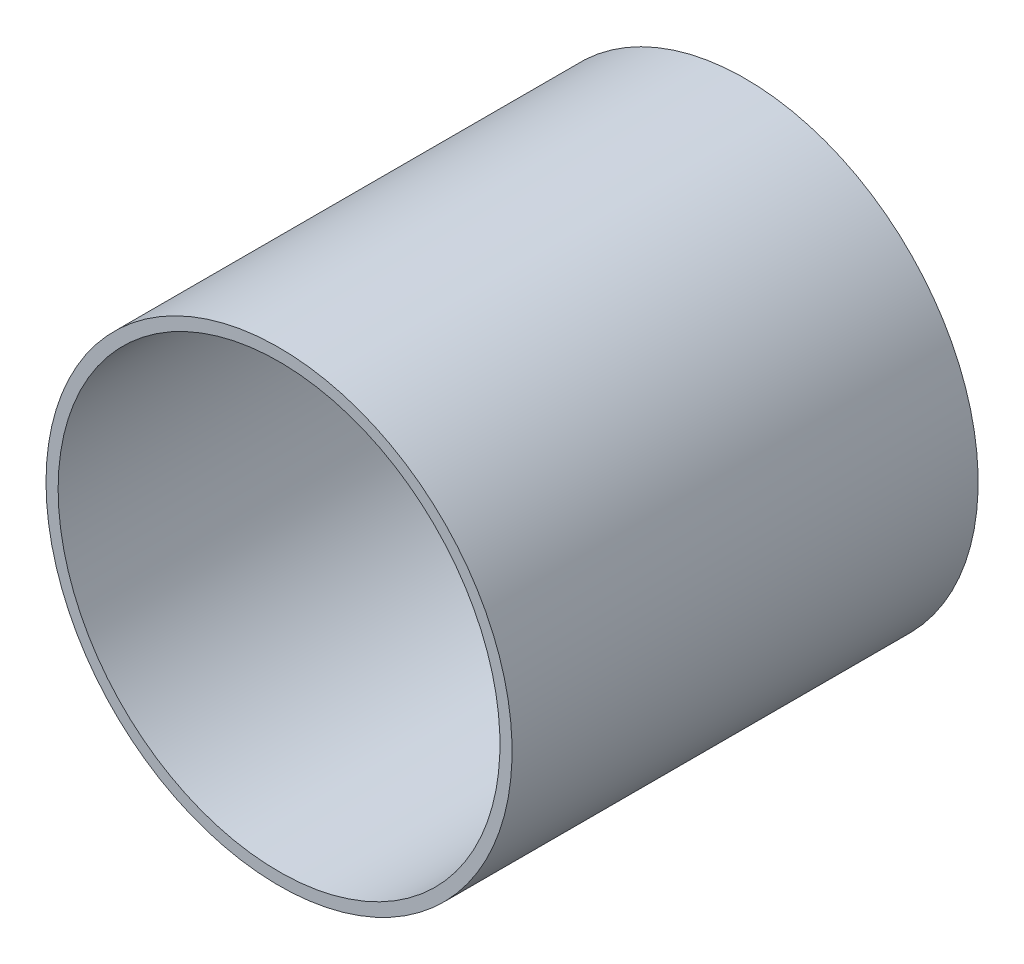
ISO-10303-21;
HEADER;
FILE_DESCRIPTION(('STEP AP214'),'2;1');
FILE_NAME('part.step','',(''),(''),'','','');
FILE_SCHEMA(('AUTOMOTIVE_DESIGN { 1 0 10303 214 1 1 1 1 }'));
ENDSEC;
DATA;
#1=APPLICATION_CONTEXT('core data for automotive mechanical design processes');
#2=APPLICATION_PROTOCOL_DEFINITION('international standard','automotive_design',2000,#1);
#3=PRODUCT_CONTEXT('',#1,'mechanical');
#4=PRODUCT('Part','Part','',(#3));
#5=PRODUCT_RELATED_PRODUCT_CATEGORY('part','',(#4));
#6=PRODUCT_DEFINITION_FORMATION('','',#4);
#7=PRODUCT_DEFINITION_CONTEXT('part definition',#1,'design');
#8=PRODUCT_DEFINITION('design','',#6,#7);
#9=PRODUCT_DEFINITION_SHAPE('','',#8);
#10=(LENGTH_UNIT() NAMED_UNIT(*) SI_UNIT(.MILLI.,.METRE.));
#11=(NAMED_UNIT(*) PLANE_ANGLE_UNIT() SI_UNIT($,.RADIAN.));
#12=(NAMED_UNIT(*) SI_UNIT($,.STERADIAN.) SOLID_ANGLE_UNIT());
#13=UNCERTAINTY_MEASURE_WITH_UNIT(LENGTH_MEASURE(1.E-05),#10,'distance_accuracy_value','');
#14=(GEOMETRIC_REPRESENTATION_CONTEXT(3) GLOBAL_UNCERTAINTY_ASSIGNED_CONTEXT((#13)) GLOBAL_UNIT_ASSIGNED_CONTEXT((#10,
#11,#12)) REPRESENTATION_CONTEXT('',''));
#15=CARTESIAN_POINT('',(0.,0.,0.));
#16=DIRECTION('',(0.,0.,1.));
#17=DIRECTION('',(1.,0.,0.));
#18=AXIS2_PLACEMENT_3D('',#15,#16,#17);
#19=CARTESIAN_POINT('',(0.,0.,0.));
#20=DIRECTION('',(0.,0.,-1.));
#21=DIRECTION('',(-1.,0.,0.));
#22=AXIS2_PLACEMENT_3D('',#19,#20,#21);
#23=CYLINDRICAL_SURFACE('',#22,31.75);
#24=CARTESIAN_POINT('',(0.,0.,63.5));
#25=DIRECTION('',(0.,0.,-1.));
#26=DIRECTION('',(-1.,0.,0.));
#27=AXIS2_PLACEMENT_3D('',#24,#25,#26);
#28=CIRCLE('',#27,31.75);
#29=CARTESIAN_POINT('',(-31.75,0.,63.5));
#30=VERTEX_POINT('',#29);
#31=EDGE_CURVE('E10',#30,#30,#28,.T.);
#32=ORIENTED_EDGE('',*,*,#31,.T.);
#33=EDGE_LOOP('',(#32));
#34=FACE_BOUND('',#33,.T.);
#35=CARTESIAN_POINT('',(0.,0.,0.));
#36=DIRECTION('',(0.,0.,-1.));
#37=DIRECTION('',(-1.,0.,0.));
#38=AXIS2_PLACEMENT_3D('',#35,#36,#37);
#39=CIRCLE('',#38,31.75);
#40=CARTESIAN_POINT('',(-31.75,0.,0.));
#41=VERTEX_POINT('',#40);
#42=EDGE_CURVE('E46',#41,#41,#39,.T.);
#43=ORIENTED_EDGE('',*,*,#42,.F.);
#44=EDGE_LOOP('',(#43));
#45=FACE_BOUND('',#44,.T.);
#46=ADVANCED_FACE('F32',(#34,#45),#23,.T.);
#47=CARTESIAN_POINT('',(-31.75,0.,63.5));
#48=DIRECTION('',(0.,0.,1.));
#49=DIRECTION('',(1.,0.,0.));
#50=AXIS2_PLACEMENT_3D('',#47,#48,#49);
#51=PLANE('',#50);
#52=CARTESIAN_POINT('',(0.,0.,63.5));
#53=DIRECTION('',(0.,0.,-1.));
#54=DIRECTION('',(-1.,0.,0.));
#55=AXIS2_PLACEMENT_3D('',#52,#53,#54);
#56=CIRCLE('',#55,30.099);
#57=CARTESIAN_POINT('',(-30.099,0.,63.5));
#58=VERTEX_POINT('',#57);
#59=EDGE_CURVE('E38',#58,#58,#56,.T.);
#60=ORIENTED_EDGE('',*,*,#59,.T.);
#61=EDGE_LOOP('',(#60));
#62=FACE_BOUND('',#61,.T.);
#63=ORIENTED_EDGE('',*,*,#31,.F.);
#64=EDGE_LOOP('',(#63));
#65=FACE_BOUND('',#64,.T.);
#66=ADVANCED_FACE('F56',(#62,#65),#51,.T.);
#67=CARTESIAN_POINT('',(0.,0.,0.));
#68=DIRECTION('',(0.,0.,-1.));
#69=DIRECTION('',(-1.,0.,0.));
#70=AXIS2_PLACEMENT_3D('',#67,#68,#69);
#71=CYLINDRICAL_SURFACE('',#70,30.099);
#72=CARTESIAN_POINT('',(0.,0.,0.));
#73=DIRECTION('',(0.,0.,-1.));
#74=DIRECTION('',(-1.,0.,0.));
#75=AXIS2_PLACEMENT_3D('',#72,#73,#74);
#76=CIRCLE('',#75,30.099);
#77=CARTESIAN_POINT('',(-30.099,0.,0.));
#78=VERTEX_POINT('',#77);
#79=EDGE_CURVE('E42',#78,#78,#76,.T.);
#80=ORIENTED_EDGE('',*,*,#79,.T.);
#81=EDGE_LOOP('',(#80));
#82=FACE_BOUND('',#81,.T.);
#83=ORIENTED_EDGE('',*,*,#59,.F.);
#84=EDGE_LOOP('',(#83));
#85=FACE_BOUND('',#84,.T.);
#86=ADVANCED_FACE('F60',(#82,#85),#71,.F.);
#87=CARTESIAN_POINT('',(-30.099,0.,0.));
#88=DIRECTION('',(0.,0.,-1.));
#89=DIRECTION('',(-1.,0.,0.));
#90=AXIS2_PLACEMENT_3D('',#87,#88,#89);
#91=PLANE('',#90);
#92=ORIENTED_EDGE('',*,*,#42,.T.);
#93=EDGE_LOOP('',(#92));
#94=FACE_BOUND('',#93,.T.);
#95=ORIENTED_EDGE('',*,*,#79,.F.);
#96=EDGE_LOOP('',(#95));
#97=FACE_BOUND('',#96,.T.);
#98=ADVANCED_FACE('F52',(#94,#97),#91,.T.);
#99=CLOSED_SHELL('',(#46,#66,#86,#98));
#100=MANIFOLD_SOLID_BREP('B2',#99);
#101=ADVANCED_BREP_SHAPE_REPRESENTATION('',(#18,#100),#14);
#102=SHAPE_DEFINITION_REPRESENTATION(#9,#101);
ENDSEC;
END-ISO-10303-21;
